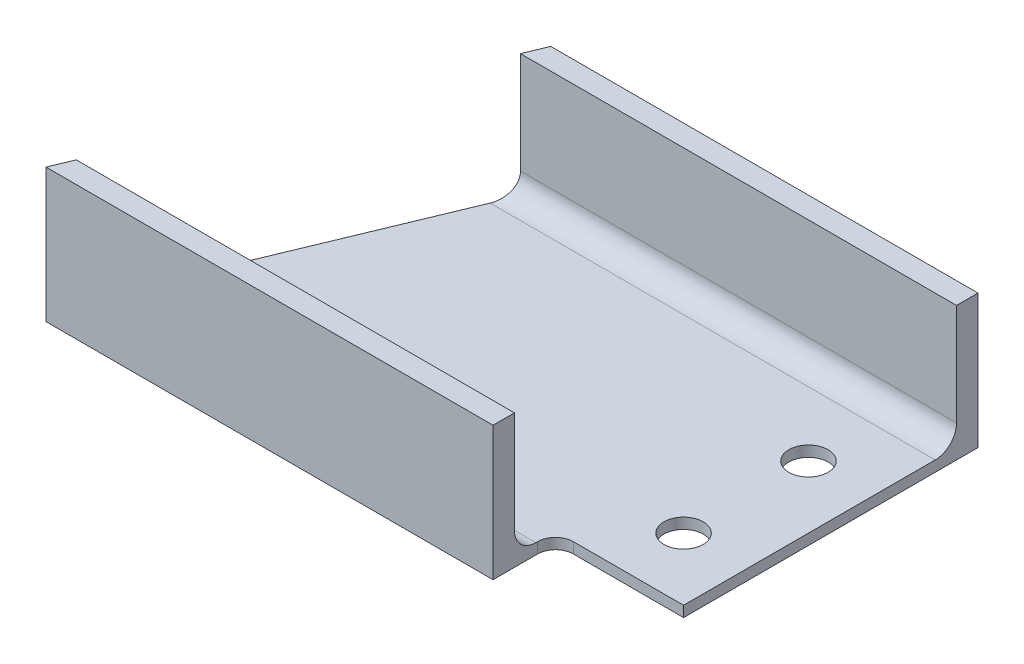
ISO-10303-21;
HEADER;
FILE_DESCRIPTION(('STEP AP214'),'2;1');
FILE_NAME('part.step','',(''),(''),'','','');
FILE_SCHEMA(('AUTOMOTIVE_DESIGN { 1 0 10303 214 1 1 1 1 }'));
ENDSEC;
DATA;
#1=APPLICATION_CONTEXT('core data for automotive mechanical design processes');
#2=APPLICATION_PROTOCOL_DEFINITION('international standard','automotive_design',2000,#1);
#3=PRODUCT_CONTEXT('',#1,'mechanical');
#4=PRODUCT('Part','Part','',(#3));
#5=PRODUCT_RELATED_PRODUCT_CATEGORY('part','',(#4));
#6=PRODUCT_DEFINITION_FORMATION('','',#4);
#7=PRODUCT_DEFINITION_CONTEXT('part definition',#1,'design');
#8=PRODUCT_DEFINITION('design','',#6,#7);
#9=PRODUCT_DEFINITION_SHAPE('','',#8);
#10=(LENGTH_UNIT() NAMED_UNIT(*) SI_UNIT(.MILLI.,.METRE.));
#11=(NAMED_UNIT(*) PLANE_ANGLE_UNIT() SI_UNIT($,.RADIAN.));
#12=(NAMED_UNIT(*) SI_UNIT($,.STERADIAN.) SOLID_ANGLE_UNIT());
#13=UNCERTAINTY_MEASURE_WITH_UNIT(LENGTH_MEASURE(1.E-05),#10,'distance_accuracy_value','');
#14=(GEOMETRIC_REPRESENTATION_CONTEXT(3) GLOBAL_UNCERTAINTY_ASSIGNED_CONTEXT((#13)) GLOBAL_UNIT_ASSIGNED_CONTEXT((#10,
#11,#12)) REPRESENTATION_CONTEXT('',''));
#15=CARTESIAN_POINT('',(0.,0.,0.));
#16=DIRECTION('',(0.,0.,1.));
#17=DIRECTION('',(1.,0.,0.));
#18=AXIS2_PLACEMENT_3D('',#15,#16,#17);
#19=CARTESIAN_POINT('',(345.,18.0000000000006,-176.));
#20=DIRECTION('',(-1.,0.,0.));
#21=DIRECTION('',(0.,0.,1.));
#22=AXIS2_PLACEMENT_3D('',#19,#20,#21);
#23=CYLINDRICAL_SURFACE('',#22,12.);
#24=DIRECTION('',(-1.,0.,0.));
#25=VECTOR('',#24,1.);
#26=CARTESIAN_POINT('',(345.,6.0000000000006,-176.));
#27=LINE('',#26,#25);
#28=CARTESIAN_POINT('',(322.249999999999,6.00000000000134,-175.999999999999));
#29=VERTEX_POINT('',#28);
#30=CARTESIAN_POINT('',(72.9015869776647,6.0000000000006,-176.));
#31=VERTEX_POINT('',#30);
#32=EDGE_CURVE('E235',#29,#31,#27,.T.);
#33=ORIENTED_EDGE('',*,*,#32,.F.);
#34=CARTESIAN_POINT('',(322.249999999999,18.0000000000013,-175.999999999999));
#35=DIRECTION('',(1.,0.,0.));
#36=DIRECTION('',(0.,0.,-1.));
#37=AXIS2_PLACEMENT_3D('',#34,#35,#36);
#38=CIRCLE('',#37,12.);
#39=CARTESIAN_POINT('',(322.249999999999,18.0000000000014,-187.999999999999));
#40=VERTEX_POINT('',#39);
#41=EDGE_CURVE('E287',#40,#29,#38,.F.);
#42=ORIENTED_EDGE('',*,*,#41,.F.);
#43=DIRECTION('',(-1.,0.,0.));
#44=VECTOR('',#43,1.);
#45=CARTESIAN_POINT('',(345.,18.0000000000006,-188.));
#46=LINE('',#45,#44);
#47=CARTESIAN_POINT('',(77.8721497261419,18.0000000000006,-188.));
#48=VERTEX_POINT('',#47);
#49=EDGE_CURVE('E213',#40,#48,#46,.T.);
#50=ORIENTED_EDGE('',*,*,#49,.T.);
#51=CARTESIAN_POINT('',(72.9015869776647,18.0000000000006,-176.));
#52=DIRECTION('',(-0.923879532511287,0.,-0.38268343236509));
#53=DIRECTION('',(-0.38268343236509,0.,0.923879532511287));
#54=AXIS2_PLACEMENT_3D('',#51,#52,#53);
#55=ELLIPSE('',#54,12.9887064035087,12.);
#56=EDGE_CURVE('E232',#48,#31,#55,.T.);
#57=ORIENTED_EDGE('',*,*,#56,.T.);
#58=EDGE_LOOP('',(#33,#42,#50,#57));
#59=FACE_BOUND('',#58,.T.);
#60=ADVANCED_FACE('F74',(#59),#23,.F.);
#61=CARTESIAN_POINT('',(345.,6.00000000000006,-24.));
#62=DIRECTION('',(0.,1.,0.));
#63=DIRECTION('',(0.,0.,1.));
#64=AXIS2_PLACEMENT_3D('',#61,#62,#63);
#65=PLANE('',#64);
#66=CARTESIAN_POINT('',(287.249999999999,6.00000000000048,-139.999999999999));
#67=DIRECTION('',(0.,1.,0.));
#68=DIRECTION('',(0.,0.,1.));
#69=AXIS2_PLACEMENT_3D('',#66,#67,#68);
#70=CIRCLE('',#69,11.);
#71=CARTESIAN_POINT('',(287.249999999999,6.00000000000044,-128.999999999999));
#72=VERTEX_POINT('',#71);
#73=EDGE_CURVE('E206',#72,#72,#70,.F.);
#74=ORIENTED_EDGE('',*,*,#73,.T.);
#75=EDGE_LOOP('',(#74));
#76=FACE_BOUND('',#75,.T.);
#77=CARTESIAN_POINT('',(287.249999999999,6.00000000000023,-69.9999999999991));
#78=DIRECTION('',(0.,1.,0.));
#79=DIRECTION('',(0.,0.,1.));
#80=AXIS2_PLACEMENT_3D('',#77,#78,#79);
#81=CIRCLE('',#80,11.);
#82=CARTESIAN_POINT('',(287.249999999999,6.00000000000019,-58.9999999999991));
#83=VERTEX_POINT('',#82);
#84=EDGE_CURVE('E210',#83,#83,#81,.F.);
#85=ORIENTED_EDGE('',*,*,#84,.T.);
#86=EDGE_LOOP('',(#85));
#87=FACE_BOUND('',#86,.T.);
#88=DIRECTION('',(-1.,0.,0.));
#89=VECTOR('',#88,1.);
#90=CARTESIAN_POINT('',(-55.000000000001,6.00000000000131,-34.999999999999));
#91=LINE('',#90,#89);
#92=CARTESIAN_POINT('',(322.249999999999,6.00000000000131,-34.9999999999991));
#93=VERTEX_POINT('',#92);
#94=CARTESIAN_POINT('',(260.499999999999,6.00000000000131,-34.9999999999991));
#95=VERTEX_POINT('',#94);
#96=EDGE_CURVE('E189',#93,#95,#91,.T.);
#97=ORIENTED_EDGE('',*,*,#96,.F.);
#98=DIRECTION('',(0.,0.,1.));
#99=VECTOR('',#98,1.);
#100=CARTESIAN_POINT('',(322.249999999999,6.00000000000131,-23.9999999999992));
#101=LINE('',#100,#99);
#102=EDGE_CURVE('E203',#29,#93,#101,.T.);
#103=ORIENTED_EDGE('',*,*,#102,.F.);
#104=ORIENTED_EDGE('',*,*,#32,.T.);
#105=DIRECTION('',(-0.38268343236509,0.,0.923879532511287));
#106=VECTOR('',#105,1.);
#107=CARTESIAN_POINT('',(59.0093616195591,6.00000000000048,-142.461201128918));
#108=LINE('',#107,#106);
#109=CARTESIAN_POINT('',(9.94112549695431,6.00000000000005,-24.));
#110=VERTEX_POINT('',#109);
#111=EDGE_CURVE('E236',#31,#110,#108,.T.);
#112=ORIENTED_EDGE('',*,*,#111,.T.);
#113=DIRECTION('',(-1.,0.,0.));
#114=VECTOR('',#113,1.);
#115=CARTESIAN_POINT('',(345.,6.00000000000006,-24.));
#116=LINE('',#115,#114);
#117=CARTESIAN_POINT('',(250.499999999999,6.00000000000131,-23.9999999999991));
#118=VERTEX_POINT('',#117);
#119=EDGE_CURVE('E194',#118,#110,#116,.T.);
#120=ORIENTED_EDGE('',*,*,#119,.F.);
#121=DIRECTION('',(0.,0.,1.));
#122=VECTOR('',#121,1.);
#123=CARTESIAN_POINT('',(250.499999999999,6.00000000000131,-23.9999999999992));
#124=LINE('',#123,#122);
#125=CARTESIAN_POINT('',(250.499999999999,6.00000000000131,-24.9999999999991));
#126=VERTEX_POINT('',#125);
#127=EDGE_CURVE('E174',#126,#118,#124,.T.);
#128=ORIENTED_EDGE('',*,*,#127,.F.);
#129=CARTESIAN_POINT('',(260.499999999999,6.00000000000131,-24.9999999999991));
#130=DIRECTION('',(0.,-1.,0.));
#131=DIRECTION('',(0.,0.,1.));
#132=AXIS2_PLACEMENT_3D('',#129,#130,#131);
#133=CIRCLE('',#132,10.);
#134=EDGE_CURVE('E184',#95,#126,#133,.F.);
#135=ORIENTED_EDGE('',*,*,#134,.F.);
#136=EDGE_LOOP('',(#97,#103,#104,#112,#120,#128,#135));
#137=FACE_BOUND('',#136,.T.);
#138=ADVANCED_FACE('F192',(#76,#87,#137),#65,.T.);
#139=CARTESIAN_POINT('',(345.,18.0000000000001,-23.9999999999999));
#140=DIRECTION('',(-1.,0.,0.));
#141=DIRECTION('',(0.,0.,1.));
#142=AXIS2_PLACEMENT_3D('',#139,#140,#141);
#143=CYLINDRICAL_SURFACE('',#142,12.);
#144=CARTESIAN_POINT('',(250.499999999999,18.0000000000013,-23.9999999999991));
#145=DIRECTION('',(1.,0.,0.));
#146=DIRECTION('',(0.,0.,-1.));
#147=AXIS2_PLACEMENT_3D('',#144,#145,#146);
#148=CIRCLE('',#147,12.);
#149=CARTESIAN_POINT('',(250.499999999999,18.0000000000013,-11.9999999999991));
#150=VERTEX_POINT('',#149);
#151=EDGE_CURVE('E298',#150,#118,#148,.T.);
#152=ORIENTED_EDGE('',*,*,#151,.T.);
#153=ORIENTED_EDGE('',*,*,#119,.T.);
#154=CARTESIAN_POINT('',(9.94112549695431,18.0000000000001,-23.9999999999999));
#155=DIRECTION('',(-0.923879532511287,0.,-0.38268343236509));
#156=DIRECTION('',(-0.38268343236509,0.,0.923879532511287));
#157=AXIS2_PLACEMENT_3D('',#154,#155,#156);
#158=ELLIPSE('',#157,12.9887064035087,12.);
#159=CARTESIAN_POINT('',(4.97056274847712,18.,-11.9999999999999));
#160=VERTEX_POINT('',#159);
#161=EDGE_CURVE('E215',#160,#110,#158,.F.);
#162=ORIENTED_EDGE('',*,*,#161,.F.);
#163=DIRECTION('',(-1.,0.,0.));
#164=VECTOR('',#163,1.);
#165=CARTESIAN_POINT('',(345.,18.,-11.9999999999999));
#166=LINE('',#165,#164);
#167=EDGE_CURVE('E244',#150,#160,#166,.T.);
#168=ORIENTED_EDGE('',*,*,#167,.F.);
#169=EDGE_LOOP('',(#152,#153,#162,#168));
#170=FACE_BOUND('',#169,.T.);
#171=ADVANCED_FACE('F325',(#170),#143,.F.);
#172=CARTESIAN_POINT('',(345.,75.,-11.9999999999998));
#173=DIRECTION('',(0.,0.,-1.));
#174=DIRECTION('',(0.,1.,0.));
#175=AXIS2_PLACEMENT_3D('',#172,#173,#174);
#176=PLANE('',#175);
#177=DIRECTION('',(-1.,0.,0.));
#178=VECTOR('',#177,1.);
#179=CARTESIAN_POINT('',(345.,75.,-11.9999999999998));
#180=LINE('',#179,#178);
#181=CARTESIAN_POINT('',(250.499999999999,75.0000000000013,-11.9999999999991));
#182=VERTEX_POINT('',#181);
#183=CARTESIAN_POINT('',(4.97056274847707,75.,-11.9999999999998));
#184=VERTEX_POINT('',#183);
#185=EDGE_CURVE('E243',#182,#184,#180,.T.);
#186=ORIENTED_EDGE('',*,*,#185,.F.);
#187=DIRECTION('',(0.,1.,0.));
#188=VECTOR('',#187,1.);
#189=CARTESIAN_POINT('',(250.499999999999,75.0000000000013,-11.9999999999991));
#190=LINE('',#189,#188);
#191=EDGE_CURVE('E296',#150,#182,#190,.T.);
#192=ORIENTED_EDGE('',*,*,#191,.F.);
#193=ORIENTED_EDGE('',*,*,#167,.T.);
#194=DIRECTION('',(0.,1.,0.));
#195=VECTOR('',#194,1.);
#196=CARTESIAN_POINT('',(4.97056274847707,74.9999999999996,-11.9999999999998));
#197=LINE('',#196,#195);
#198=EDGE_CURVE('E240',#160,#184,#197,.T.);
#199=ORIENTED_EDGE('',*,*,#198,.T.);
#200=EDGE_LOOP('',(#186,#192,#193,#199));
#201=FACE_BOUND('',#200,.T.);
#202=ADVANCED_FACE('F329',(#201),#176,.T.);
#203=CARTESIAN_POINT('',(345.,75.,2.61861100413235E-13));
#204=DIRECTION('',(0.,1.,0.));
#205=DIRECTION('',(0.,0.,1.));
#206=AXIS2_PLACEMENT_3D('',#203,#204,#205);
#207=PLANE('',#206);
#208=DIRECTION('',(-1.,0.,0.));
#209=VECTOR('',#208,1.);
#210=CARTESIAN_POINT('',(345.,75.,2.61861100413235E-13));
#211=LINE('',#210,#209);
#212=CARTESIAN_POINT('',(250.499999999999,75.,2.61861100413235E-13));
#213=VERTEX_POINT('',#212);
#214=CARTESIAN_POINT('',(0.,75.0000000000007,0.));
#215=VERTEX_POINT('',#214);
#216=EDGE_CURVE('E98',#213,#215,#211,.T.);
#217=ORIENTED_EDGE('',*,*,#216,.F.);
#218=DIRECTION('',(0.,0.,1.));
#219=VECTOR('',#218,1.);
#220=CARTESIAN_POINT('',(250.499999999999,75.0000000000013,8.33424839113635E-13));
#221=LINE('',#220,#219);
#222=EDGE_CURVE('E91',#182,#213,#221,.T.);
#223=ORIENTED_EDGE('',*,*,#222,.F.);
#224=ORIENTED_EDGE('',*,*,#185,.T.);
#225=DIRECTION('',(-0.38268343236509,0.,0.923879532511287));
#226=VECTOR('',#225,1.);
#227=CARTESIAN_POINT('',(50.5240802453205,75.0000000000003,-121.975919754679));
#228=LINE('',#227,#226);
#229=EDGE_CURVE('E219',#184,#215,#228,.T.);
#230=ORIENTED_EDGE('',*,*,#229,.T.);
#231=EDGE_LOOP('',(#217,#223,#224,#230));
#232=FACE_BOUND('',#231,.T.);
#233=ADVANCED_FACE('F263',(#232),#207,.T.);
#234=CARTESIAN_POINT('',(345.,0.,0.));
#235=DIRECTION('',(0.,1.,0.));
#236=DIRECTION('',(0.,0.,1.));
#237=AXIS2_PLACEMENT_3D('',#234,#235,#236);
#238=PLANE('',#237);
#239=CARTESIAN_POINT('',(287.249999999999,2.35922392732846E-13,-69.9999999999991));
#240=DIRECTION('',(0.,1.,0.));
#241=DIRECTION('',(0.,0.,1.));
#242=AXIS2_PLACEMENT_3D('',#239,#240,#241);
#243=CIRCLE('',#242,11.);
#244=CARTESIAN_POINT('',(287.249999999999,1.98279376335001E-13,-58.9999999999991));
#245=VERTEX_POINT('',#244);
#246=EDGE_CURVE('E209',#245,#245,#243,.F.);
#247=ORIENTED_EDGE('',*,*,#246,.F.);
#248=EDGE_LOOP('',(#247));
#249=FACE_BOUND('',#248,.T.);
#250=CARTESIAN_POINT('',(287.249999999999,4.85722573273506E-13,-139.999999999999));
#251=DIRECTION('',(0.,1.,0.));
#252=DIRECTION('',(0.,0.,1.));
#253=AXIS2_PLACEMENT_3D('',#250,#251,#252);
#254=CIRCLE('',#253,11.);
#255=CARTESIAN_POINT('',(287.249999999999,4.48079556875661E-13,-128.999999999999));
#256=VERTEX_POINT('',#255);
#257=EDGE_CURVE('E78',#256,#256,#254,.F.);
#258=ORIENTED_EDGE('',*,*,#257,.F.);
#259=EDGE_LOOP('',(#258));
#260=FACE_BOUND('',#259,.T.);
#261=DIRECTION('',(0.,0.,1.));
#262=VECTOR('',#261,1.);
#263=CARTESIAN_POINT('',(322.249999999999,1.33226762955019E-12,8.39467826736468E-13));
#264=LINE('',#263,#262);
#265=CARTESIAN_POINT('',(322.249999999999,1.34288277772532E-12,-199.999999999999));
#266=VERTEX_POINT('',#265);
#267=CARTESIAN_POINT('',(322.249999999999,1.3365538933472E-12,-34.9999999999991));
#268=VERTEX_POINT('',#267);
#269=EDGE_CURVE('E195',#266,#268,#264,.T.);
#270=ORIENTED_EDGE('',*,*,#269,.T.);
#271=DIRECTION('',(-1.,0.,0.));
#272=VECTOR('',#271,1.);
#273=CARTESIAN_POINT('',(-55.0000000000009,1.33412528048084E-12,-34.999999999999));
#274=LINE('',#273,#272);
#275=CARTESIAN_POINT('',(260.499999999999,1.3365538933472E-12,-34.9999999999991));
#276=VERTEX_POINT('',#275);
#277=EDGE_CURVE('E271',#268,#276,#274,.T.);
#278=ORIENTED_EDGE('',*,*,#277,.T.);
#279=CARTESIAN_POINT('',(260.499999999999,1.33532924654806E-12,-24.9999999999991));
#280=DIRECTION('',(0.,-1.,0.));
#281=DIRECTION('',(0.,0.,1.));
#282=AXIS2_PLACEMENT_3D('',#279,#280,#281);
#283=CIRCLE('',#282,10.);
#284=CARTESIAN_POINT('',(250.499999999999,1.33532924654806E-12,-24.9999999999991));
#285=VERTEX_POINT('',#284);
#286=EDGE_CURVE('E290',#276,#285,#283,.F.);
#287=ORIENTED_EDGE('',*,*,#286,.T.);
#288=DIRECTION('',(0.,0.,1.));
#289=VECTOR('',#288,1.);
#290=CARTESIAN_POINT('',(250.499999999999,1.33226762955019E-12,8.20076651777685E-13));
#291=LINE('',#290,#289);
#292=CARTESIAN_POINT('',(250.499999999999,1.33226762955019E-12,8.76605507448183E-13));
#293=VERTEX_POINT('',#292);
#294=EDGE_CURVE('E177',#285,#293,#291,.T.);
#295=ORIENTED_EDGE('',*,*,#294,.T.);
#296=DIRECTION('',(-1.,0.,0.));
#297=VECTOR('',#296,1.);
#298=CARTESIAN_POINT('',(345.,0.,0.));
#299=LINE('',#298,#297);
#300=CARTESIAN_POINT('',(0.,0.,0.));
#301=VERTEX_POINT('',#300);
#302=EDGE_CURVE('E217',#293,#301,#299,.T.);
#303=ORIENTED_EDGE('',*,*,#302,.T.);
#304=DIRECTION('',(-0.38268343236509,0.,0.923879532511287));
#305=VECTOR('',#304,1.);
#306=CARTESIAN_POINT('',(50.5240802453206,4.17412867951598E-13,-121.975919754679));
#307=LINE('',#306,#305);
#308=CARTESIAN_POINT('',(82.842712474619,6.84418479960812E-13,-200.));
#309=VERTEX_POINT('',#308);
#310=EDGE_CURVE('E83',#309,#301,#307,.T.);
#311=ORIENTED_EDGE('',*,*,#310,.F.);
#312=DIRECTION('',(-1.,0.,0.));
#313=VECTOR('',#312,1.);
#314=CARTESIAN_POINT('',(345.,6.84418479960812E-13,-200.));
#315=LINE('',#314,#313);
#316=EDGE_CURVE('E218',#266,#309,#315,.T.);
#317=ORIENTED_EDGE('',*,*,#316,.F.);
#318=EDGE_LOOP('',(#270,#278,#287,#295,#303,#311,#317));
#319=FACE_BOUND('',#318,.T.);
#320=ADVANCED_FACE('F259',(#249,#260,#319),#238,.F.);
#321=CARTESIAN_POINT('',(345.,6.84418479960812E-13,-200.));
#322=DIRECTION('',(0.,0.,1.));
#323=DIRECTION('',(0.,-1.,0.));
#324=AXIS2_PLACEMENT_3D('',#321,#322,#323);
#325=PLANE('',#324);
#326=DIRECTION('',(0.,-1.,0.));
#327=VECTOR('',#326,1.);
#328=CARTESIAN_POINT('',(322.249999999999,1.34288277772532E-12,-199.999999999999));
#329=LINE('',#328,#327);
#330=CARTESIAN_POINT('',(322.249999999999,75.0000000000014,-199.999999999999));
#331=VERTEX_POINT('',#330);
#332=EDGE_CURVE('E198',#331,#266,#329,.T.);
#333=ORIENTED_EDGE('',*,*,#332,.T.);
#334=ORIENTED_EDGE('',*,*,#316,.T.);
#335=DIRECTION('',(0.,-1.,0.));
#336=VECTOR('',#335,1.);
#337=CARTESIAN_POINT('',(82.842712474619,3.01019276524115E-13,-200.));
#338=LINE('',#337,#336);
#339=CARTESIAN_POINT('',(82.8427124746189,75.0000000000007,-200.));
#340=VERTEX_POINT('',#339);
#341=EDGE_CURVE('E223',#340,#309,#338,.T.);
#342=ORIENTED_EDGE('',*,*,#341,.F.);
#343=DIRECTION('',(-1.,0.,0.));
#344=VECTOR('',#343,1.);
#345=CARTESIAN_POINT('',(345.,75.0000000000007,-200.));
#346=LINE('',#345,#344);
#347=EDGE_CURVE('E251',#331,#340,#346,.T.);
#348=ORIENTED_EDGE('',*,*,#347,.F.);
#349=EDGE_LOOP('',(#333,#334,#342,#348));
#350=FACE_BOUND('',#349,.T.);
#351=ADVANCED_FACE('F262',(#350),#325,.F.);
#352=CARTESIAN_POINT('',(345.,75.0000000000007,-200.));
#353=DIRECTION('',(0.,-1.,0.));
#354=DIRECTION('',(0.,0.,-1.));
#355=AXIS2_PLACEMENT_3D('',#352,#353,#354);
#356=PLANE('',#355);
#357=DIRECTION('',(0.,0.,-1.));
#358=VECTOR('',#357,1.);
#359=CARTESIAN_POINT('',(322.249999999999,75.0000000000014,-199.999999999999));
#360=LINE('',#359,#358);
#361=CARTESIAN_POINT('',(322.249999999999,75.0000000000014,-187.999999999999));
#362=VERTEX_POINT('',#361);
#363=EDGE_CURVE('E281',#362,#331,#360,.T.);
#364=ORIENTED_EDGE('',*,*,#363,.T.);
#365=ORIENTED_EDGE('',*,*,#347,.T.);
#366=DIRECTION('',(0.38268343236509,0.,-0.923879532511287));
#367=VECTOR('',#366,1.);
#368=CARTESIAN_POINT('',(121.234758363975,75.000000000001,-292.686597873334));
#369=LINE('',#368,#367);
#370=CARTESIAN_POINT('',(77.8721497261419,75.0000000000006,-188.));
#371=VERTEX_POINT('',#370);
#372=EDGE_CURVE('E226',#371,#340,#369,.T.);
#373=ORIENTED_EDGE('',*,*,#372,.F.);
#374=DIRECTION('',(-1.,0.,0.));
#375=VECTOR('',#374,1.);
#376=CARTESIAN_POINT('',(345.,75.0000000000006,-188.));
#377=LINE('',#376,#375);
#378=EDGE_CURVE('E216',#362,#371,#377,.T.);
#379=ORIENTED_EDGE('',*,*,#378,.F.);
#380=EDGE_LOOP('',(#364,#365,#373,#379));
#381=FACE_BOUND('',#380,.T.);
#382=ADVANCED_FACE('F312',(#381),#356,.F.);
#383=CARTESIAN_POINT('',(345.,75.0000000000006,-188.));
#384=DIRECTION('',(0.,0.,-1.));
#385=DIRECTION('',(0.,1.,0.));
#386=AXIS2_PLACEMENT_3D('',#383,#384,#385);
#387=PLANE('',#386);
#388=DIRECTION('',(0.,1.,0.));
#389=VECTOR('',#388,1.);
#390=CARTESIAN_POINT('',(322.249999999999,75.0000000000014,-187.999999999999));
#391=LINE('',#390,#389);
#392=EDGE_CURVE('E282',#40,#362,#391,.T.);
#393=ORIENTED_EDGE('',*,*,#392,.T.);
#394=ORIENTED_EDGE('',*,*,#378,.T.);
#395=DIRECTION('',(0.,1.,0.));
#396=VECTOR('',#395,1.);
#397=CARTESIAN_POINT('',(77.8721497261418,75.0000000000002,-188.));
#398=LINE('',#397,#396);
#399=EDGE_CURVE('E229',#48,#371,#398,.T.);
#400=ORIENTED_EDGE('',*,*,#399,.F.);
#401=ORIENTED_EDGE('',*,*,#49,.F.);
#402=EDGE_LOOP('',(#393,#394,#400,#401));
#403=FACE_BOUND('',#402,.T.);
#404=ADVANCED_FACE('F316',(#403),#387,.F.);
#405=CARTESIAN_POINT('',(345.,0.,0.));
#406=DIRECTION('',(0.,0.,1.));
#407=DIRECTION('',(0.,-1.,0.));
#408=AXIS2_PLACEMENT_3D('',#405,#406,#407);
#409=PLANE('',#408);
#410=ORIENTED_EDGE('',*,*,#302,.F.);
#411=DIRECTION('',(0.,-1.,0.));
#412=VECTOR('',#411,1.);
#413=CARTESIAN_POINT('',(250.499999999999,1.33226762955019E-12,8.76605507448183E-13));
#414=LINE('',#413,#412);
#415=EDGE_CURVE('E293',#213,#293,#414,.T.);
#416=ORIENTED_EDGE('',*,*,#415,.F.);
#417=ORIENTED_EDGE('',*,*,#216,.T.);
#418=DIRECTION('',(0.,1.,0.));
#419=VECTOR('',#418,1.);
#420=CARTESIAN_POINT('',(0.,18.0000000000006,0.));
#421=LINE('',#420,#419);
#422=EDGE_CURVE('E13',#301,#215,#421,.T.);
#423=ORIENTED_EDGE('',*,*,#422,.F.);
#424=EDGE_LOOP('',(#410,#416,#417,#423));
#425=FACE_BOUND('',#424,.T.);
#426=ADVANCED_FACE('F304',(#425),#409,.T.);
#427=CARTESIAN_POINT('',(0.,0.,0.));
#428=DIRECTION('',(-0.923879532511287,0.,-0.38268343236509));
#429=DIRECTION('',(-0.38268343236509,0.,0.923879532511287));
#430=AXIS2_PLACEMENT_3D('',#427,#428,#429);
#431=PLANE('',#430);
#432=ORIENTED_EDGE('',*,*,#229,.F.);
#433=ORIENTED_EDGE('',*,*,#198,.F.);
#434=ORIENTED_EDGE('',*,*,#161,.T.);
#435=ORIENTED_EDGE('',*,*,#111,.F.);
#436=ORIENTED_EDGE('',*,*,#56,.F.);
#437=ORIENTED_EDGE('',*,*,#399,.T.);
#438=ORIENTED_EDGE('',*,*,#372,.T.);
#439=ORIENTED_EDGE('',*,*,#341,.T.);
#440=ORIENTED_EDGE('',*,*,#310,.T.);
#441=ORIENTED_EDGE('',*,*,#422,.T.);
#442=EDGE_LOOP('',(#432,#433,#434,#435,#436,#437,#438,#439,#440,#441));
#443=FACE_BOUND('',#442,.T.);
#444=ADVANCED_FACE('F76',(#443),#431,.T.);
#445=CARTESIAN_POINT('',(287.249999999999,-81.9999999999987,-69.9999999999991));
#446=DIRECTION('',(0.,1.,0.));
#447=DIRECTION('',(-1.,0.,0.));
#448=AXIS2_PLACEMENT_3D('',#445,#446,#447);
#449=CYLINDRICAL_SURFACE('',#448,11.);
#450=ORIENTED_EDGE('',*,*,#84,.F.);
#451=EDGE_LOOP('',(#450));
#452=FACE_BOUND('',#451,.T.);
#453=ORIENTED_EDGE('',*,*,#246,.T.);
#454=EDGE_LOOP('',(#453));
#455=FACE_BOUND('',#454,.T.);
#456=ADVANCED_FACE('F257',(#452,#455),#449,.F.);
#457=CARTESIAN_POINT('',(287.249999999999,-81.9999999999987,-139.999999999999));
#458=DIRECTION('',(0.,1.,0.));
#459=DIRECTION('',(-1.,0.,0.));
#460=AXIS2_PLACEMENT_3D('',#457,#458,#459);
#461=CYLINDRICAL_SURFACE('',#460,11.);
#462=ORIENTED_EDGE('',*,*,#73,.F.);
#463=EDGE_LOOP('',(#462));
#464=FACE_BOUND('',#463,.T.);
#465=ORIENTED_EDGE('',*,*,#257,.T.);
#466=EDGE_LOOP('',(#465));
#467=FACE_BOUND('',#466,.T.);
#468=ADVANCED_FACE('F412',(#464,#467),#461,.F.);
#469=CARTESIAN_POINT('',(260.499999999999,150.000000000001,-34.999999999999));
#470=DIRECTION('',(0.,0.,1.));
#471=DIRECTION('',(1.,0.,0.));
#472=AXIS2_PLACEMENT_3D('',#469,#470,#471);
#473=PLANE('',#472);
#474=ORIENTED_EDGE('',*,*,#277,.F.);
#475=DIRECTION('',(0.,-1.,0.));
#476=VECTOR('',#475,1.);
#477=CARTESIAN_POINT('',(322.249999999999,150.000000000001,-34.999999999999));
#478=LINE('',#477,#476);
#479=EDGE_CURVE('E277',#93,#268,#478,.T.);
#480=ORIENTED_EDGE('',*,*,#479,.F.);
#481=ORIENTED_EDGE('',*,*,#96,.T.);
#482=DIRECTION('',(0.,-1.,0.));
#483=VECTOR('',#482,1.);
#484=CARTESIAN_POINT('',(260.499999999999,150.000000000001,-34.999999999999));
#485=LINE('',#484,#483);
#486=EDGE_CURVE('E181',#95,#276,#485,.T.);
#487=ORIENTED_EDGE('',*,*,#486,.T.);
#488=EDGE_LOOP('',(#474,#480,#481,#487));
#489=FACE_BOUND('',#488,.T.);
#490=ADVANCED_FACE('F302',(#489),#473,.T.);
#491=CARTESIAN_POINT('',(260.499999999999,150.000000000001,-24.999999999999));
#492=DIRECTION('',(0.,-1.,0.));
#493=DIRECTION('',(1.,0.,0.));
#494=AXIS2_PLACEMENT_3D('',#491,#492,#493);
#495=CYLINDRICAL_SURFACE('',#494,10.);
#496=ORIENTED_EDGE('',*,*,#286,.F.);
#497=ORIENTED_EDGE('',*,*,#486,.F.);
#498=ORIENTED_EDGE('',*,*,#134,.T.);
#499=DIRECTION('',(0.,-1.,0.));
#500=VECTOR('',#499,1.);
#501=CARTESIAN_POINT('',(250.499999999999,150.000000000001,-24.999999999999));
#502=LINE('',#501,#500);
#503=EDGE_CURVE('E170',#126,#285,#502,.T.);
#504=ORIENTED_EDGE('',*,*,#503,.T.);
#505=EDGE_LOOP('',(#496,#497,#498,#504));
#506=FACE_BOUND('',#505,.T.);
#507=ADVANCED_FACE('F185',(#506),#495,.F.);
#508=CARTESIAN_POINT('',(322.249999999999,150.000000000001,-34.999999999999));
#509=DIRECTION('',(1.,0.,0.));
#510=DIRECTION('',(0.,0.,-1.));
#511=AXIS2_PLACEMENT_3D('',#508,#509,#510);
#512=PLANE('',#511);
#513=ORIENTED_EDGE('',*,*,#269,.F.);
#514=ORIENTED_EDGE('',*,*,#332,.F.);
#515=ORIENTED_EDGE('',*,*,#363,.F.);
#516=ORIENTED_EDGE('',*,*,#392,.F.);
#517=ORIENTED_EDGE('',*,*,#41,.T.);
#518=ORIENTED_EDGE('',*,*,#102,.T.);
#519=ORIENTED_EDGE('',*,*,#479,.T.);
#520=EDGE_LOOP('',(#513,#514,#515,#516,#517,#518,#519));
#521=FACE_BOUND('',#520,.T.);
#522=ADVANCED_FACE('F275',(#521),#512,.T.);
#523=CARTESIAN_POINT('',(250.499999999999,150.000000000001,200.000000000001));
#524=DIRECTION('',(1.,0.,0.));
#525=DIRECTION('',(0.,0.,-1.));
#526=AXIS2_PLACEMENT_3D('',#523,#524,#525);
#527=PLANE('',#526);
#528=ORIENTED_EDGE('',*,*,#294,.F.);
#529=ORIENTED_EDGE('',*,*,#503,.F.);
#530=ORIENTED_EDGE('',*,*,#127,.T.);
#531=ORIENTED_EDGE('',*,*,#151,.F.);
#532=ORIENTED_EDGE('',*,*,#191,.T.);
#533=ORIENTED_EDGE('',*,*,#222,.T.);
#534=ORIENTED_EDGE('',*,*,#415,.T.);
#535=EDGE_LOOP('',(#528,#529,#530,#531,#532,#533,#534));
#536=FACE_BOUND('',#535,.T.);
#537=ADVANCED_FACE('F172',(#536),#527,.T.);
#538=CLOSED_SHELL('',(#60,#138,#171,#202,#233,#320,#351,#382,#404,#426,#444,#456,#468,#490,#507,
#522,#537));
#539=MANIFOLD_SOLID_BREP('B2',#538);
#540=ADVANCED_BREP_SHAPE_REPRESENTATION('',(#18,#539),#14);
#541=SHAPE_DEFINITION_REPRESENTATION(#9,#540);
ENDSEC;
END-ISO-10303-21;
